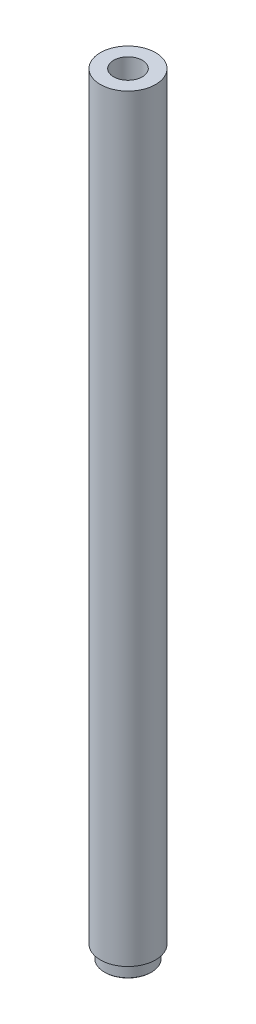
from build123d import *
from build123d.topology import SkipClean

# Parameters (mm, degrees)
SKETCH1_R           = 6.35
SKETCH1_R_2         = 3.302
BOSS_EXTRUDE1_DEPTH = 87.1347
BOSS_EXTRUDE2_START = 3.048
SKETCH2_R           = 5.3975
SKETCH2_R_2         = 3.302
BOSS_EXTRUDE2_DEPTH = 3.048
CHAMFER1_SIZE       = 0.127


with BuildPart() as part:
    # Sketch1 → Boss-Extrude1 (new, symmetric)
    with BuildSketch(Plane(origin=(0, 0, 0), x_dir=(1, 0, 0), z_dir=(0, 1, 0))):
        with Locations(Location((0, 0, 0), (0, 0, 270))):
            Circle(SKETCH1_R)
        with Locations(Location((0, 0, 0), (0, 0, 270))):
            Circle(SKETCH1_R_2, mode=Mode.SUBTRACT)
    extrude(amount=BOSS_EXTRUDE1_DEPTH, both=True)

    # Sketch2 → Boss-Extrude2 (add)
    with SkipClean():  # the faces are left unmerged after this step: merging them gives an invalid solid
        with BuildSketch(Plane.XZ.offset(87.1347).offset(BOSS_EXTRUDE2_START)):
            with Locations(Location((0, 0, 0), (0, 0, 90))):
                Circle(SKETCH2_R)
            with Locations(Location((0, 0, 0), (0, 0, 270))):
                Circle(SKETCH2_R_2, mode=Mode.SUBTRACT)
        extrude(amount=-BOSS_EXTRUDE2_DEPTH)

    # Chamfer1
    chamfer1_edges = [part.edges().sort_by_distance(p)[0] for p in [
        (0, -90.1827, -5.3975),
    ]]
    chamfer(chamfer1_edges, length=CHAMFER1_SIZE)


solid = part.part
